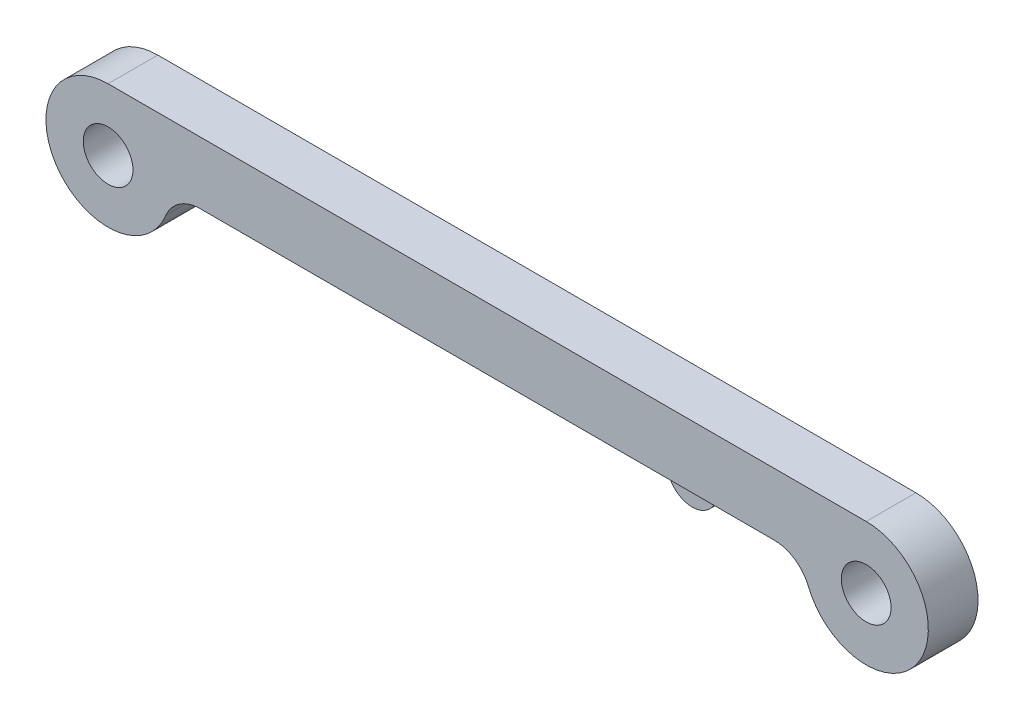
ISO-10303-21;
HEADER;
FILE_DESCRIPTION(('STEP AP214'),'2;1');
FILE_NAME('part.step','',(''),(''),'','','');
FILE_SCHEMA(('AUTOMOTIVE_DESIGN { 1 0 10303 214 1 1 1 1 }'));
ENDSEC;
DATA;
#1=APPLICATION_CONTEXT('core data for automotive mechanical design processes');
#2=APPLICATION_PROTOCOL_DEFINITION('international standard','automotive_design',2000,#1);
#3=PRODUCT_CONTEXT('',#1,'mechanical');
#4=PRODUCT('Part','Part','',(#3));
#5=PRODUCT_RELATED_PRODUCT_CATEGORY('part','',(#4));
#6=PRODUCT_DEFINITION_FORMATION('','',#4);
#7=PRODUCT_DEFINITION_CONTEXT('part definition',#1,'design');
#8=PRODUCT_DEFINITION('design','',#6,#7);
#9=PRODUCT_DEFINITION_SHAPE('','',#8);
#10=(LENGTH_UNIT() NAMED_UNIT(*) SI_UNIT(.MILLI.,.METRE.));
#11=(NAMED_UNIT(*) PLANE_ANGLE_UNIT() SI_UNIT($,.RADIAN.));
#12=(NAMED_UNIT(*) SI_UNIT($,.STERADIAN.) SOLID_ANGLE_UNIT());
#13=UNCERTAINTY_MEASURE_WITH_UNIT(LENGTH_MEASURE(1.E-05),#10,'distance_accuracy_value','');
#14=(GEOMETRIC_REPRESENTATION_CONTEXT(3) GLOBAL_UNCERTAINTY_ASSIGNED_CONTEXT((#13)) GLOBAL_UNIT_ASSIGNED_CONTEXT((#10,
#11,#12)) REPRESENTATION_CONTEXT('',''));
#15=CARTESIAN_POINT('',(0.,0.,0.));
#16=DIRECTION('',(0.,0.,1.));
#17=DIRECTION('',(1.,0.,0.));
#18=AXIS2_PLACEMENT_3D('',#15,#16,#17);
#19=CARTESIAN_POINT('',(-55.8049486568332,-3.5,4.));
#20=DIRECTION('',(0.,0.,1.));
#21=DIRECTION('',(1.,0.,0.));
#22=AXIS2_PLACEMENT_3D('',#19,#20,#21);
#23=PLANE('',#22);
#24=CARTESIAN_POINT('',(-63.2211471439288,-0.499999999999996,4.));
#25=DIRECTION('',(0.,0.,1.));
#26=DIRECTION('',(1.,0.,0.));
#27=AXIS2_PLACEMENT_3D('',#24,#25,#26);
#28=CIRCLE('',#27,2.);
#29=CARTESIAN_POINT('',(-61.2211471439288,-0.499999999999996,4.));
#30=VERTEX_POINT('',#29);
#31=EDGE_CURVE('E166',#30,#30,#28,.T.);
#32=ORIENTED_EDGE('',*,*,#31,.F.);
#33=EDGE_LOOP('',(#32));
#34=FACE_BOUND('',#33,.T.);
#35=CARTESIAN_POINT('',(-55.8049486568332,-3.5,4.));
#36=DIRECTION('',(0.,0.,-1.));
#37=DIRECTION('',(1.,0.,0.));
#38=AXIS2_PLACEMENT_3D('',#35,#36,#37);
#39=CIRCLE('',#38,3.);
#40=CARTESIAN_POINT('',(-58.586023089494,-2.375,4.));
#41=VERTEX_POINT('',#40);
#42=CARTESIAN_POINT('',(-55.8049486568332,-0.499999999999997,4.));
#43=VERTEX_POINT('',#42);
#44=EDGE_CURVE('E172',#41,#43,#39,.T.);
#45=ORIENTED_EDGE('',*,*,#44,.T.);
#46=DIRECTION('',(1.,0.,0.));
#47=VECTOR('',#46,1.);
#48=CARTESIAN_POINT('',(-55.8049486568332,-0.499999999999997,4.));
#49=LINE('',#48,#47);
#50=CARTESIAN_POINT('',(-9.63734563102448,-0.499999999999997,4.));
#51=VERTEX_POINT('',#50);
#52=EDGE_CURVE('E175',#43,#51,#49,.T.);
#53=ORIENTED_EDGE('',*,*,#52,.T.);
#54=CARTESIAN_POINT('',(-9.63734563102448,-3.5,4.));
#55=DIRECTION('',(0.,0.,-1.));
#56=DIRECTION('',(-1.,0.,0.));
#57=AXIS2_PLACEMENT_3D('',#54,#55,#56);
#58=CIRCLE('',#57,3.);
#59=CARTESIAN_POINT('',(-6.85627119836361,-2.375,4.));
#60=VERTEX_POINT('',#59);
#61=EDGE_CURVE('E178',#51,#60,#58,.T.);
#62=ORIENTED_EDGE('',*,*,#61,.T.);
#63=CARTESIAN_POINT('',(-2.22114714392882,-0.499999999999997,4.));
#64=DIRECTION('',(0.,0.,1.));
#65=DIRECTION('',(1.,0.,0.));
#66=AXIS2_PLACEMENT_3D('',#63,#64,#65);
#67=CIRCLE('',#66,5.);
#68=CARTESIAN_POINT('',(-2.22114714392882,4.5,4.));
#69=VERTEX_POINT('',#68);
#70=EDGE_CURVE('E180',#60,#69,#67,.T.);
#71=ORIENTED_EDGE('',*,*,#70,.T.);
#72=DIRECTION('',(-1.,0.,0.));
#73=VECTOR('',#72,1.);
#74=CARTESIAN_POINT('',(-63.2211471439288,4.5,4.));
#75=LINE('',#74,#73);
#76=CARTESIAN_POINT('',(-63.2211471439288,4.5,4.));
#77=VERTEX_POINT('',#76);
#78=EDGE_CURVE('E182',#69,#77,#75,.T.);
#79=ORIENTED_EDGE('',*,*,#78,.T.);
#80=CARTESIAN_POINT('',(-63.2211471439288,-0.499999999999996,4.));
#81=DIRECTION('',(0.,0.,1.));
#82=DIRECTION('',(1.,0.,0.));
#83=AXIS2_PLACEMENT_3D('',#80,#81,#82);
#84=CIRCLE('',#83,5.);
#85=EDGE_CURVE('E184',#77,#41,#84,.T.);
#86=ORIENTED_EDGE('',*,*,#85,.T.);
#87=EDGE_LOOP('',(#45,#53,#62,#71,#79,#86));
#88=FACE_BOUND('',#87,.T.);
#89=CARTESIAN_POINT('',(-2.22114714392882,-0.499999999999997,4.));
#90=DIRECTION('',(0.,0.,1.));
#91=DIRECTION('',(1.,0.,0.));
#92=AXIS2_PLACEMENT_3D('',#89,#90,#91);
#93=CIRCLE('',#92,2.);
#94=CARTESIAN_POINT('',(-0.221147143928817,-0.499999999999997,4.));
#95=VERTEX_POINT('',#94);
#96=EDGE_CURVE('E160',#95,#95,#93,.T.);
#97=ORIENTED_EDGE('',*,*,#96,.F.);
#98=EDGE_LOOP('',(#97));
#99=FACE_BOUND('',#98,.T.);
#100=ADVANCED_FACE('F34',(#34,#88,#99),#23,.T.);
#101=CARTESIAN_POINT('',(-55.8049486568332,-3.5,0.));
#102=DIRECTION('',(0.,0.,1.));
#103=DIRECTION('',(1.,0.,0.));
#104=AXIS2_PLACEMENT_3D('',#101,#102,#103);
#105=PLANE('',#104);
#106=CARTESIAN_POINT('',(-63.2211471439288,-0.499999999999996,0.));
#107=DIRECTION('',(0.,0.,1.));
#108=DIRECTION('',(1.,0.,0.));
#109=AXIS2_PLACEMENT_3D('',#106,#107,#108);
#110=CIRCLE('',#109,2.);
#111=CARTESIAN_POINT('',(-61.2211471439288,-0.499999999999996,0.));
#112=VERTEX_POINT('',#111);
#113=EDGE_CURVE('E163',#112,#112,#110,.T.);
#114=ORIENTED_EDGE('',*,*,#113,.T.);
#115=EDGE_LOOP('',(#114));
#116=FACE_BOUND('',#115,.T.);
#117=CARTESIAN_POINT('',(-55.8049486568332,-3.5,0.));
#118=DIRECTION('',(0.,0.,-1.));
#119=DIRECTION('',(1.,0.,0.));
#120=AXIS2_PLACEMENT_3D('',#117,#118,#119);
#121=CIRCLE('',#120,3.);
#122=CARTESIAN_POINT('',(-58.586023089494,-2.375,0.));
#123=VERTEX_POINT('',#122);
#124=CARTESIAN_POINT('',(-55.8049486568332,-0.499999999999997,0.));
#125=VERTEX_POINT('',#124);
#126=EDGE_CURVE('E169',#123,#125,#121,.T.);
#127=ORIENTED_EDGE('',*,*,#126,.F.);
#128=CARTESIAN_POINT('',(-63.2211471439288,-0.499999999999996,0.));
#129=DIRECTION('',(0.,0.,1.));
#130=DIRECTION('',(1.,0.,0.));
#131=AXIS2_PLACEMENT_3D('',#128,#129,#130);
#132=CIRCLE('',#131,5.);
#133=CARTESIAN_POINT('',(-63.2211471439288,4.5,0.));
#134=VERTEX_POINT('',#133);
#135=EDGE_CURVE('E176',#134,#123,#132,.T.);
#136=ORIENTED_EDGE('',*,*,#135,.F.);
#137=DIRECTION('',(-1.,0.,0.));
#138=VECTOR('',#137,1.);
#139=CARTESIAN_POINT('',(-63.2211471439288,4.5,0.));
#140=LINE('',#139,#138);
#141=CARTESIAN_POINT('',(-2.22114714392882,4.5,0.));
#142=VERTEX_POINT('',#141);
#143=EDGE_CURVE('E195',#142,#134,#140,.T.);
#144=ORIENTED_EDGE('',*,*,#143,.F.);
#145=CARTESIAN_POINT('',(-2.22114714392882,-0.499999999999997,0.));
#146=DIRECTION('',(0.,0.,1.));
#147=DIRECTION('',(1.,0.,0.));
#148=AXIS2_PLACEMENT_3D('',#145,#146,#147);
#149=CIRCLE('',#148,5.);
#150=CARTESIAN_POINT('',(-6.85627119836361,-2.375,0.));
#151=VERTEX_POINT('',#150);
#152=EDGE_CURVE('E193',#151,#142,#149,.T.);
#153=ORIENTED_EDGE('',*,*,#152,.F.);
#154=CARTESIAN_POINT('',(-9.63734563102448,-3.5,0.));
#155=DIRECTION('',(0.,0.,-1.));
#156=DIRECTION('',(-1.,0.,0.));
#157=AXIS2_PLACEMENT_3D('',#154,#155,#156);
#158=CIRCLE('',#157,3.);
#159=CARTESIAN_POINT('',(-9.63734563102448,-0.499999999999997,0.));
#160=VERTEX_POINT('',#159);
#161=EDGE_CURVE('E191',#160,#151,#158,.T.);
#162=ORIENTED_EDGE('',*,*,#161,.F.);
#163=DIRECTION('',(1.,0.,0.));
#164=VECTOR('',#163,1.);
#165=CARTESIAN_POINT('',(-55.8049486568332,-0.499999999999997,0.));
#166=LINE('',#165,#164);
#167=EDGE_CURVE('E189',#125,#160,#166,.T.);
#168=ORIENTED_EDGE('',*,*,#167,.F.);
#169=EDGE_LOOP('',(#127,#136,#144,#153,#162,#168));
#170=FACE_BOUND('',#169,.T.);
#171=CARTESIAN_POINT('',(-2.22114714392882,-0.499999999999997,0.));
#172=DIRECTION('',(0.,0.,1.));
#173=DIRECTION('',(1.,0.,0.));
#174=AXIS2_PLACEMENT_3D('',#171,#172,#173);
#175=CIRCLE('',#174,2.);
#176=CARTESIAN_POINT('',(-0.221147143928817,-0.499999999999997,0.));
#177=VERTEX_POINT('',#176);
#178=EDGE_CURVE('E158',#177,#177,#175,.T.);
#179=ORIENTED_EDGE('',*,*,#178,.T.);
#180=EDGE_LOOP('',(#179));
#181=FACE_BOUND('',#180,.T.);
#182=ADVANCED_FACE('F247',(#116,#170,#181),#105,.F.);
#183=CARTESIAN_POINT('',(-55.8049486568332,-3.5,4.));
#184=DIRECTION('',(0.,0.,-1.));
#185=DIRECTION('',(-1.,0.,0.));
#186=AXIS2_PLACEMENT_3D('',#183,#184,#185);
#187=CYLINDRICAL_SURFACE('',#186,3.);
#188=ORIENTED_EDGE('',*,*,#126,.T.);
#189=DIRECTION('',(0.,0.,-1.));
#190=VECTOR('',#189,1.);
#191=CARTESIAN_POINT('',(-55.8049486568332,-0.499999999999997,4.));
#192=LINE('',#191,#190);
#193=EDGE_CURVE('E146',#43,#125,#192,.T.);
#194=ORIENTED_EDGE('',*,*,#193,.F.);
#195=ORIENTED_EDGE('',*,*,#44,.F.);
#196=DIRECTION('',(0.,0.,-1.));
#197=VECTOR('',#196,1.);
#198=CARTESIAN_POINT('',(-58.586023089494,-2.375,4.));
#199=LINE('',#198,#197);
#200=EDGE_CURVE('E186',#41,#123,#199,.T.);
#201=ORIENTED_EDGE('',*,*,#200,.T.);
#202=EDGE_LOOP('',(#188,#194,#195,#201));
#203=FACE_BOUND('',#202,.T.);
#204=ADVANCED_FACE('F238',(#203),#187,.F.);
#205=CARTESIAN_POINT('',(-55.8049486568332,-0.499999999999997,4.));
#206=DIRECTION('',(0.,1.,0.));
#207=DIRECTION('',(0.,0.,1.));
#208=AXIS2_PLACEMENT_3D('',#205,#206,#207);
#209=PLANE('',#208);
#210=DIRECTION('',(0.,0.,1.));
#211=VECTOR('',#210,1.);
#212=CARTESIAN_POINT('',(-20.049574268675,-0.499999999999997,4.));
#213=LINE('',#212,#211);
#214=CARTESIAN_POINT('',(-20.049574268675,-0.499999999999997,1.));
#215=VERTEX_POINT('',#214);
#216=CARTESIAN_POINT('',(-20.049574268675,-0.499999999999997,3.));
#217=VERTEX_POINT('',#216);
#218=EDGE_CURVE('E218',#215,#217,#213,.T.);
#219=ORIENTED_EDGE('',*,*,#218,.T.);
#220=DIRECTION('',(1.,0.,0.));
#221=VECTOR('',#220,1.);
#222=CARTESIAN_POINT('',(-55.8049486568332,-0.499999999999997,3.));
#223=LINE('',#222,#221);
#224=CARTESIAN_POINT('',(-18.2211471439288,-0.499999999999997,3.));
#225=VERTEX_POINT('',#224);
#226=EDGE_CURVE('E214',#217,#225,#223,.T.);
#227=ORIENTED_EDGE('',*,*,#226,.T.);
#228=DIRECTION('',(0.,0.,1.));
#229=VECTOR('',#228,1.);
#230=CARTESIAN_POINT('',(-18.2211471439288,-0.499999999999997,1.));
#231=LINE('',#230,#229);
#232=CARTESIAN_POINT('',(-18.2211471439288,-0.499999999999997,1.));
#233=VERTEX_POINT('',#232);
#234=EDGE_CURVE('E134',#233,#225,#231,.T.);
#235=ORIENTED_EDGE('',*,*,#234,.F.);
#236=DIRECTION('',(1.,0.,0.));
#237=VECTOR('',#236,1.);
#238=CARTESIAN_POINT('',(-55.8049486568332,-0.499999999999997,1.));
#239=LINE('',#238,#237);
#240=EDGE_CURVE('E137',#215,#233,#239,.T.);
#241=ORIENTED_EDGE('',*,*,#240,.F.);
#242=EDGE_LOOP('',(#219,#227,#235,#241));
#243=FACE_BOUND('',#242,.T.);
#244=DIRECTION('',(0.,0.,1.));
#245=VECTOR('',#244,1.);
#246=CARTESIAN_POINT('',(-14.3927200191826,-0.499999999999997,4.));
#247=LINE('',#246,#245);
#248=CARTESIAN_POINT('',(-14.3927200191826,-0.499999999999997,3.));
#249=VERTEX_POINT('',#248);
#250=CARTESIAN_POINT('',(-14.3927200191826,-0.499999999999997,1.));
#251=VERTEX_POINT('',#250);
#252=EDGE_CURVE('E130',#249,#251,#247,.F.);
#253=ORIENTED_EDGE('',*,*,#252,.T.);
#254=CARTESIAN_POINT('',(-16.2211471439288,-0.499999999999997,1.));
#255=VERTEX_POINT('',#254);
#256=EDGE_CURVE('E123',#255,#251,#239,.T.);
#257=ORIENTED_EDGE('',*,*,#256,.F.);
#258=DIRECTION('',(0.,0.,1.));
#259=VECTOR('',#258,1.);
#260=CARTESIAN_POINT('',(-16.2211471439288,-0.499999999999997,1.));
#261=LINE('',#260,#259);
#262=CARTESIAN_POINT('',(-16.2211471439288,-0.499999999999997,3.));
#263=VERTEX_POINT('',#262);
#264=EDGE_CURVE('E127',#263,#255,#261,.F.);
#265=ORIENTED_EDGE('',*,*,#264,.F.);
#266=EDGE_CURVE('E135',#263,#249,#223,.T.);
#267=ORIENTED_EDGE('',*,*,#266,.T.);
#268=EDGE_LOOP('',(#253,#257,#265,#267));
#269=FACE_BOUND('',#268,.T.);
#270=ORIENTED_EDGE('',*,*,#167,.T.);
#271=DIRECTION('',(0.,0.,-1.));
#272=VECTOR('',#271,1.);
#273=CARTESIAN_POINT('',(-9.63734563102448,-0.499999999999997,4.));
#274=LINE('',#273,#272);
#275=EDGE_CURVE('E209',#51,#160,#274,.T.);
#276=ORIENTED_EDGE('',*,*,#275,.F.);
#277=ORIENTED_EDGE('',*,*,#52,.F.);
#278=ORIENTED_EDGE('',*,*,#193,.T.);
#279=EDGE_LOOP('',(#270,#276,#277,#278));
#280=FACE_BOUND('',#279,.T.);
#281=ADVANCED_FACE('F125',(#243,#269,#280),#209,.F.);
#282=CARTESIAN_POINT('',(-9.63734563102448,-3.5,4.));
#283=DIRECTION('',(0.,0.,-1.));
#284=DIRECTION('',(-1.,0.,0.));
#285=AXIS2_PLACEMENT_3D('',#282,#283,#284);
#286=CYLINDRICAL_SURFACE('',#285,3.);
#287=ORIENTED_EDGE('',*,*,#161,.T.);
#288=DIRECTION('',(0.,0.,-1.));
#289=VECTOR('',#288,1.);
#290=CARTESIAN_POINT('',(-6.85627119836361,-2.375,4.));
#291=LINE('',#290,#289);
#292=EDGE_CURVE('E206',#60,#151,#291,.T.);
#293=ORIENTED_EDGE('',*,*,#292,.F.);
#294=ORIENTED_EDGE('',*,*,#61,.F.);
#295=ORIENTED_EDGE('',*,*,#275,.T.);
#296=EDGE_LOOP('',(#287,#293,#294,#295));
#297=FACE_BOUND('',#296,.T.);
#298=ADVANCED_FACE('F237',(#297),#286,.F.);
#299=CARTESIAN_POINT('',(-2.22114714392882,-0.499999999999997,4.));
#300=DIRECTION('',(0.,0.,-1.));
#301=DIRECTION('',(-1.,0.,0.));
#302=AXIS2_PLACEMENT_3D('',#299,#300,#301);
#303=CYLINDRICAL_SURFACE('',#302,5.);
#304=ORIENTED_EDGE('',*,*,#152,.T.);
#305=DIRECTION('',(0.,0.,-1.));
#306=VECTOR('',#305,1.);
#307=CARTESIAN_POINT('',(-2.22114714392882,4.5,4.));
#308=LINE('',#307,#306);
#309=EDGE_CURVE('E203',#69,#142,#308,.T.);
#310=ORIENTED_EDGE('',*,*,#309,.F.);
#311=ORIENTED_EDGE('',*,*,#70,.F.);
#312=ORIENTED_EDGE('',*,*,#292,.T.);
#313=EDGE_LOOP('',(#304,#310,#311,#312));
#314=FACE_BOUND('',#313,.T.);
#315=ADVANCED_FACE('F244',(#314),#303,.T.);
#316=CARTESIAN_POINT('',(-63.2211471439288,4.5,4.));
#317=DIRECTION('',(0.,-1.,0.));
#318=DIRECTION('',(1.,0.,0.));
#319=AXIS2_PLACEMENT_3D('',#316,#317,#318);
#320=PLANE('',#319);
#321=ORIENTED_EDGE('',*,*,#143,.T.);
#322=DIRECTION('',(0.,0.,-1.));
#323=VECTOR('',#322,1.);
#324=CARTESIAN_POINT('',(-63.2211471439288,4.5,4.));
#325=LINE('',#324,#323);
#326=EDGE_CURVE('E200',#77,#134,#325,.T.);
#327=ORIENTED_EDGE('',*,*,#326,.F.);
#328=ORIENTED_EDGE('',*,*,#78,.F.);
#329=ORIENTED_EDGE('',*,*,#309,.T.);
#330=EDGE_LOOP('',(#321,#327,#328,#329));
#331=FACE_BOUND('',#330,.T.);
#332=ADVANCED_FACE('F267',(#331),#320,.F.);
#333=CARTESIAN_POINT('',(-63.2211471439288,-0.499999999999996,4.));
#334=DIRECTION('',(0.,0.,-1.));
#335=DIRECTION('',(-1.,0.,0.));
#336=AXIS2_PLACEMENT_3D('',#333,#334,#335);
#337=CYLINDRICAL_SURFACE('',#336,5.);
#338=ORIENTED_EDGE('',*,*,#135,.T.);
#339=ORIENTED_EDGE('',*,*,#200,.F.);
#340=ORIENTED_EDGE('',*,*,#85,.F.);
#341=ORIENTED_EDGE('',*,*,#326,.T.);
#342=EDGE_LOOP('',(#338,#339,#340,#341));
#343=FACE_BOUND('',#342,.T.);
#344=ADVANCED_FACE('F264',(#343),#337,.T.);
#345=CARTESIAN_POINT('',(-63.2211471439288,-0.499999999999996,4.));
#346=DIRECTION('',(0.,0.,-1.));
#347=DIRECTION('',(-1.,0.,0.));
#348=AXIS2_PLACEMENT_3D('',#345,#346,#347);
#349=CYLINDRICAL_SURFACE('',#348,2.);
#350=ORIENTED_EDGE('',*,*,#31,.T.);
#351=EDGE_LOOP('',(#350));
#352=FACE_BOUND('',#351,.T.);
#353=ORIENTED_EDGE('',*,*,#113,.F.);
#354=EDGE_LOOP('',(#353));
#355=FACE_BOUND('',#354,.T.);
#356=ADVANCED_FACE('F261',(#352,#355),#349,.F.);
#357=CARTESIAN_POINT('',(-2.22114714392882,-0.499999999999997,4.));
#358=DIRECTION('',(0.,0.,-1.));
#359=DIRECTION('',(-1.,0.,0.));
#360=AXIS2_PLACEMENT_3D('',#357,#358,#359);
#361=CYLINDRICAL_SURFACE('',#360,2.);
#362=ORIENTED_EDGE('',*,*,#96,.T.);
#363=EDGE_LOOP('',(#362));
#364=FACE_BOUND('',#363,.T.);
#365=ORIENTED_EDGE('',*,*,#178,.F.);
#366=EDGE_LOOP('',(#365));
#367=FACE_BOUND('',#366,.T.);
#368=ADVANCED_FACE('F297',(#364,#367),#361,.F.);
#369=CARTESIAN_POINT('',(-17.2211471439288,-0.499999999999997,1.));
#370=DIRECTION('',(0.,0.,1.));
#371=DIRECTION('',(1.,0.,0.));
#372=AXIS2_PLACEMENT_3D('',#369,#370,#371);
#373=CYLINDRICAL_SURFACE('',#372,2.);
#374=CARTESIAN_POINT('',(-17.2211471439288,-0.499999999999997,3.));
#375=DIRECTION('',(0.,0.,1.));
#376=DIRECTION('',(1.,0.,0.));
#377=AXIS2_PLACEMENT_3D('',#374,#375,#376);
#378=CIRCLE('',#377,2.);
#379=CARTESIAN_POINT('',(-19.1067652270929,-1.16666666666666,3.));
#380=VERTEX_POINT('',#379);
#381=CARTESIAN_POINT('',(-15.3355290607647,-1.16666666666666,3.));
#382=VERTEX_POINT('',#381);
#383=EDGE_CURVE('E152',#380,#382,#378,.T.);
#384=ORIENTED_EDGE('',*,*,#383,.F.);
#385=DIRECTION('',(0.,0.,1.));
#386=VECTOR('',#385,1.);
#387=CARTESIAN_POINT('',(-19.1067652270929,-1.16666666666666,1.));
#388=LINE('',#387,#386);
#389=CARTESIAN_POINT('',(-19.1067652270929,-1.16666666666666,1.));
#390=VERTEX_POINT('',#389);
#391=EDGE_CURVE('E222',#380,#390,#388,.F.);
#392=ORIENTED_EDGE('',*,*,#391,.T.);
#393=CARTESIAN_POINT('',(-17.2211471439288,-0.499999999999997,1.));
#394=DIRECTION('',(0.,0.,1.));
#395=DIRECTION('',(1.,0.,0.));
#396=AXIS2_PLACEMENT_3D('',#393,#394,#395);
#397=CIRCLE('',#396,2.);
#398=CARTESIAN_POINT('',(-15.3355290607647,-1.16666666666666,1.));
#399=VERTEX_POINT('',#398);
#400=EDGE_CURVE('E154',#390,#399,#397,.T.);
#401=ORIENTED_EDGE('',*,*,#400,.T.);
#402=DIRECTION('',(0.,0.,1.));
#403=VECTOR('',#402,1.);
#404=CARTESIAN_POINT('',(-15.3355290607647,-1.16666666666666,1.));
#405=LINE('',#404,#403);
#406=EDGE_CURVE('E49',#399,#382,#405,.T.);
#407=ORIENTED_EDGE('',*,*,#406,.T.);
#408=EDGE_LOOP('',(#384,#392,#401,#407));
#409=FACE_BOUND('',#408,.T.);
#410=ADVANCED_FACE('F228',(#409),#373,.T.);
#411=CARTESIAN_POINT('',(-17.2211471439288,-0.499999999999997,1.));
#412=DIRECTION('',(0.,0.,1.));
#413=DIRECTION('',(1.,0.,0.));
#414=AXIS2_PLACEMENT_3D('',#411,#412,#413);
#415=PLANE('',#414);
#416=ORIENTED_EDGE('',*,*,#400,.F.);
#417=CARTESIAN_POINT('',(-20.049574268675,-1.5,1.));
#418=DIRECTION('',(0.,0.,1.));
#419=DIRECTION('',(1.,0.,0.));
#420=AXIS2_PLACEMENT_3D('',#417,#418,#419);
#421=CIRCLE('',#420,1.);
#422=EDGE_CURVE('E225',#390,#215,#421,.T.);
#423=ORIENTED_EDGE('',*,*,#422,.T.);
#424=ORIENTED_EDGE('',*,*,#240,.T.);
#425=CARTESIAN_POINT('',(-17.2211471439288,-0.499999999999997,1.));
#426=DIRECTION('',(0.,0.,1.));
#427=DIRECTION('',(1.,0.,0.));
#428=AXIS2_PLACEMENT_3D('',#425,#426,#427);
#429=CIRCLE('',#428,1.);
#430=EDGE_CURVE('E143',#233,#255,#429,.T.);
#431=ORIENTED_EDGE('',*,*,#430,.T.);
#432=ORIENTED_EDGE('',*,*,#256,.T.);
#433=CARTESIAN_POINT('',(-14.3927200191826,-1.5,1.));
#434=DIRECTION('',(0.,0.,1.));
#435=DIRECTION('',(1.,0.,0.));
#436=AXIS2_PLACEMENT_3D('',#433,#434,#435);
#437=CIRCLE('',#436,1.);
#438=EDGE_CURVE('E42',#251,#399,#437,.T.);
#439=ORIENTED_EDGE('',*,*,#438,.T.);
#440=EDGE_LOOP('',(#416,#423,#424,#431,#432,#439));
#441=FACE_BOUND('',#440,.T.);
#442=ADVANCED_FACE('F150',(#441),#415,.F.);
#443=CARTESIAN_POINT('',(-17.2211471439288,-0.499999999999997,3.));
#444=DIRECTION('',(0.,0.,1.));
#445=DIRECTION('',(1.,0.,0.));
#446=AXIS2_PLACEMENT_3D('',#443,#444,#445);
#447=PLANE('',#446);
#448=ORIENTED_EDGE('',*,*,#226,.F.);
#449=CARTESIAN_POINT('',(-20.049574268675,-1.5,3.));
#450=DIRECTION('',(0.,0.,1.));
#451=DIRECTION('',(1.,0.,0.));
#452=AXIS2_PLACEMENT_3D('',#449,#450,#451);
#453=CIRCLE('',#452,1.);
#454=EDGE_CURVE('E56',#217,#380,#453,.F.);
#455=ORIENTED_EDGE('',*,*,#454,.T.);
#456=ORIENTED_EDGE('',*,*,#383,.T.);
#457=CARTESIAN_POINT('',(-14.3927200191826,-1.5,3.));
#458=DIRECTION('',(0.,0.,1.));
#459=DIRECTION('',(1.,0.,0.));
#460=AXIS2_PLACEMENT_3D('',#457,#458,#459);
#461=CIRCLE('',#460,1.);
#462=EDGE_CURVE('E11',#382,#249,#461,.F.);
#463=ORIENTED_EDGE('',*,*,#462,.T.);
#464=ORIENTED_EDGE('',*,*,#266,.F.);
#465=CARTESIAN_POINT('',(-17.2211471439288,-0.499999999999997,3.));
#466=DIRECTION('',(0.,0.,1.));
#467=DIRECTION('',(1.,0.,0.));
#468=AXIS2_PLACEMENT_3D('',#465,#466,#467);
#469=CIRCLE('',#468,1.);
#470=EDGE_CURVE('E145',#225,#263,#469,.T.);
#471=ORIENTED_EDGE('',*,*,#470,.F.);
#472=EDGE_LOOP('',(#448,#455,#456,#463,#464,#471));
#473=FACE_BOUND('',#472,.T.);
#474=ADVANCED_FACE('F231',(#473),#447,.T.);
#475=CARTESIAN_POINT('',(-17.2211471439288,-0.499999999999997,1.));
#476=DIRECTION('',(0.,0.,1.));
#477=DIRECTION('',(1.,0.,0.));
#478=AXIS2_PLACEMENT_3D('',#475,#476,#477);
#479=CYLINDRICAL_SURFACE('',#478,1.);
#480=ORIENTED_EDGE('',*,*,#430,.F.);
#481=ORIENTED_EDGE('',*,*,#234,.T.);
#482=ORIENTED_EDGE('',*,*,#470,.T.);
#483=ORIENTED_EDGE('',*,*,#264,.T.);
#484=EDGE_LOOP('',(#480,#481,#482,#483));
#485=FACE_BOUND('',#484,.T.);
#486=ADVANCED_FACE('F141',(#485),#479,.F.);
#487=CARTESIAN_POINT('',(-20.049574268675,-1.5,1.));
#488=DIRECTION('',(0.,0.,1.));
#489=DIRECTION('',(1.,0.,0.));
#490=AXIS2_PLACEMENT_3D('',#487,#488,#489);
#491=CYLINDRICAL_SURFACE('',#490,1.);
#492=ORIENTED_EDGE('',*,*,#422,.F.);
#493=ORIENTED_EDGE('',*,*,#391,.F.);
#494=ORIENTED_EDGE('',*,*,#454,.F.);
#495=ORIENTED_EDGE('',*,*,#218,.F.);
#496=EDGE_LOOP('',(#492,#493,#494,#495));
#497=FACE_BOUND('',#496,.T.);
#498=ADVANCED_FACE('F233',(#497),#491,.F.);
#499=CARTESIAN_POINT('',(-14.3927200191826,-1.5,1.));
#500=DIRECTION('',(0.,0.,1.));
#501=DIRECTION('',(1.,0.,0.));
#502=AXIS2_PLACEMENT_3D('',#499,#500,#501);
#503=CYLINDRICAL_SURFACE('',#502,1.);
#504=ORIENTED_EDGE('',*,*,#462,.F.);
#505=ORIENTED_EDGE('',*,*,#406,.F.);
#506=ORIENTED_EDGE('',*,*,#438,.F.);
#507=ORIENTED_EDGE('',*,*,#252,.F.);
#508=EDGE_LOOP('',(#504,#505,#506,#507));
#509=FACE_BOUND('',#508,.T.);
#510=ADVANCED_FACE('F36',(#509),#503,.F.);
#511=CLOSED_SHELL('',(#100,#182,#204,#281,#298,#315,#332,#344,#356,#368,#410,#442,#474,#486,
#498,#510));
#512=MANIFOLD_SOLID_BREP('B2',#511);
#513=ADVANCED_BREP_SHAPE_REPRESENTATION('',(#18,#512),#14);
#514=SHAPE_DEFINITION_REPRESENTATION(#9,#513);
ENDSEC;
END-ISO-10303-21;
